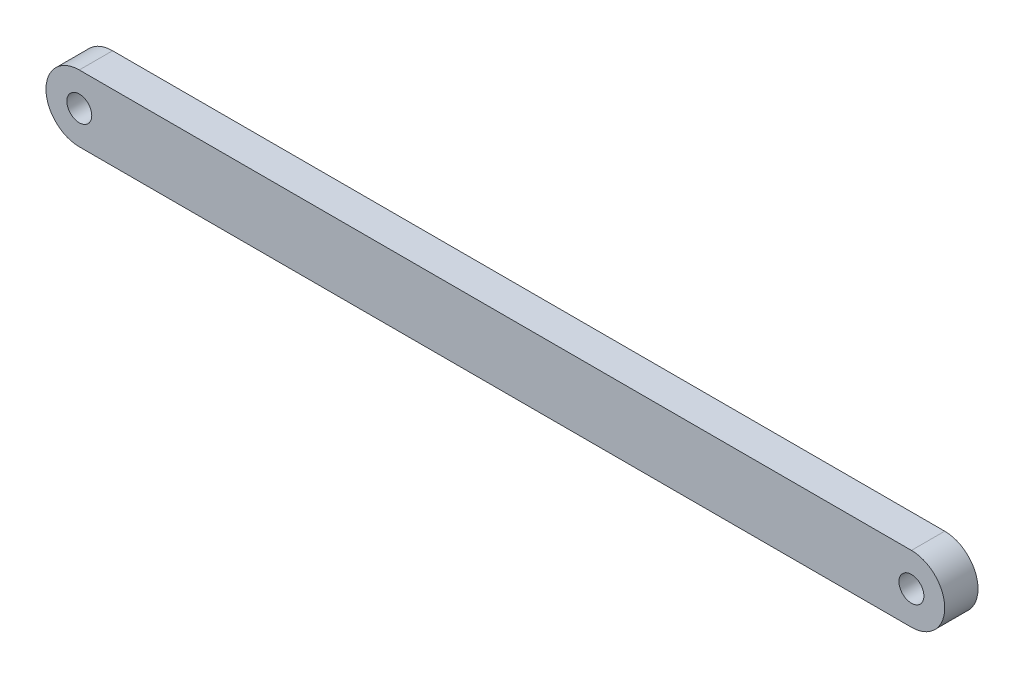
from build123d import *

# Parameters (mm, degrees)
SKETCH_1_R      = 1.5
EXTRUDE_1_DEPTH = 4


with BuildPart() as part:
    # Sketch 1 → Extrude 1 (new body)
    with BuildSketch(Plane.XY):
        with BuildLine():
            Line((-50, 4), (50, 4))
            ThreePointArc((50, 4), (54, 0), (50, -4))
            Line((50, -4), (-50, -4))
            ThreePointArc((-50, -4), (-54, 0), (-50, 4))
        make_face()
        with Locations((-50, 0)):
            Circle(SKETCH_1_R, mode=Mode.SUBTRACT)
        with Locations((50, 0)):
            Circle(SKETCH_1_R, mode=Mode.SUBTRACT)
    extrude(amount=EXTRUDE_1_DEPTH)


solid = part.part
